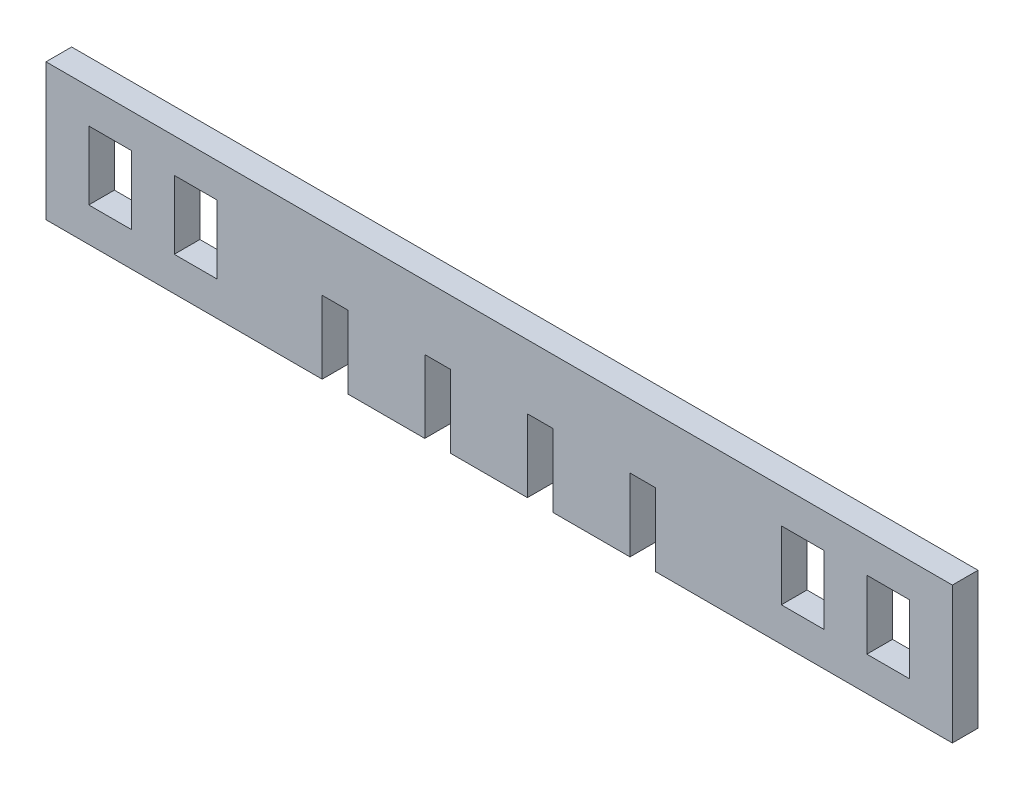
ISO-10303-21;
HEADER;
FILE_DESCRIPTION(('STEP AP214'),'2;1');
FILE_NAME('part.step','',(''),(''),'','','');
FILE_SCHEMA(('AUTOMOTIVE_DESIGN { 1 0 10303 214 1 1 1 1 }'));
ENDSEC;
DATA;
#1=APPLICATION_CONTEXT('core data for automotive mechanical design processes');
#2=APPLICATION_PROTOCOL_DEFINITION('international standard','automotive_design',2000,#1);
#3=PRODUCT_CONTEXT('',#1,'mechanical');
#4=PRODUCT('Part','Part','',(#3));
#5=PRODUCT_RELATED_PRODUCT_CATEGORY('part','',(#4));
#6=PRODUCT_DEFINITION_FORMATION('','',#4);
#7=PRODUCT_DEFINITION_CONTEXT('part definition',#1,'design');
#8=PRODUCT_DEFINITION('design','',#6,#7);
#9=PRODUCT_DEFINITION_SHAPE('','',#8);
#10=(LENGTH_UNIT() NAMED_UNIT(*) SI_UNIT(.MILLI.,.METRE.));
#11=(NAMED_UNIT(*) PLANE_ANGLE_UNIT() SI_UNIT($,.RADIAN.));
#12=(NAMED_UNIT(*) SI_UNIT($,.STERADIAN.) SOLID_ANGLE_UNIT());
#13=UNCERTAINTY_MEASURE_WITH_UNIT(LENGTH_MEASURE(1.E-05),#10,'distance_accuracy_value','');
#14=(GEOMETRIC_REPRESENTATION_CONTEXT(3) GLOBAL_UNCERTAINTY_ASSIGNED_CONTEXT((#13)) GLOBAL_UNIT_ASSIGNED_CONTEXT((#10,
#11,#12)) REPRESENTATION_CONTEXT('',''));
#15=CARTESIAN_POINT('',(0.,0.,0.));
#16=DIRECTION('',(0.,0.,1.));
#17=DIRECTION('',(1.,0.,0.));
#18=AXIS2_PLACEMENT_3D('',#15,#16,#17);
#19=CARTESIAN_POINT('',(0.,0.,3.));
#20=DIRECTION('',(0.,0.,-1.));
#21=DIRECTION('',(-1.,0.,0.));
#22=AXIS2_PLACEMENT_3D('',#19,#20,#21);
#23=PLANE('',#22);
#24=DIRECTION('',(0.,-1.,0.));
#25=VECTOR('',#24,1.);
#26=CARTESIAN_POINT('',(43.,4.,3.));
#27=LINE('',#26,#25);
#28=CARTESIAN_POINT('',(43.,4.,3.));
#29=VERTEX_POINT('',#28);
#30=CARTESIAN_POINT('',(43.,-3.99999999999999,3.));
#31=VERTEX_POINT('',#30);
#32=EDGE_CURVE('E325',#29,#31,#27,.T.);
#33=ORIENTED_EDGE('',*,*,#32,.F.);
#34=DIRECTION('',(-1.,0.,0.));
#35=VECTOR('',#34,1.);
#36=CARTESIAN_POINT('',(43.,4.,3.));
#37=LINE('',#36,#35);
#38=CARTESIAN_POINT('',(48.,4.,3.));
#39=VERTEX_POINT('',#38);
#40=EDGE_CURVE('E336',#39,#29,#37,.T.);
#41=ORIENTED_EDGE('',*,*,#40,.F.);
#42=DIRECTION('',(0.,1.,0.));
#43=VECTOR('',#42,1.);
#44=CARTESIAN_POINT('',(48.,4.,3.));
#45=LINE('',#44,#43);
#46=CARTESIAN_POINT('',(48.,-3.99999999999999,3.));
#47=VERTEX_POINT('',#46);
#48=EDGE_CURVE('E332',#47,#39,#45,.T.);
#49=ORIENTED_EDGE('',*,*,#48,.F.);
#50=DIRECTION('',(1.,0.,0.));
#51=VECTOR('',#50,1.);
#52=CARTESIAN_POINT('',(43.,-3.99999999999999,3.));
#53=LINE('',#52,#51);
#54=EDGE_CURVE('E328',#31,#47,#53,.T.);
#55=ORIENTED_EDGE('',*,*,#54,.F.);
#56=EDGE_LOOP('',(#33,#41,#49,#55));
#57=FACE_BOUND('',#56,.T.);
#58=DIRECTION('',(0.,-1.,0.));
#59=VECTOR('',#58,1.);
#60=CARTESIAN_POINT('',(-48.,4.,3.));
#61=LINE('',#60,#59);
#62=CARTESIAN_POINT('',(-48.,4.,3.));
#63=VERTEX_POINT('',#62);
#64=CARTESIAN_POINT('',(-48.,-4.,3.));
#65=VERTEX_POINT('',#64);
#66=EDGE_CURVE('E411',#63,#65,#61,.T.);
#67=ORIENTED_EDGE('',*,*,#66,.F.);
#68=DIRECTION('',(-1.,0.,0.));
#69=VECTOR('',#68,1.);
#70=CARTESIAN_POINT('',(-48.,4.,3.));
#71=LINE('',#70,#69);
#72=CARTESIAN_POINT('',(-43.,4.,3.));
#73=VERTEX_POINT('',#72);
#74=EDGE_CURVE('E422',#73,#63,#71,.T.);
#75=ORIENTED_EDGE('',*,*,#74,.F.);
#76=DIRECTION('',(0.,1.,0.));
#77=VECTOR('',#76,1.);
#78=CARTESIAN_POINT('',(-43.,4.,3.));
#79=LINE('',#78,#77);
#80=CARTESIAN_POINT('',(-43.,-4.,3.));
#81=VERTEX_POINT('',#80);
#82=EDGE_CURVE('E418',#81,#73,#79,.T.);
#83=ORIENTED_EDGE('',*,*,#82,.F.);
#84=DIRECTION('',(1.,0.,0.));
#85=VECTOR('',#84,1.);
#86=CARTESIAN_POINT('',(-48.,-4.,3.));
#87=LINE('',#86,#85);
#88=EDGE_CURVE('E414',#65,#81,#87,.T.);
#89=ORIENTED_EDGE('',*,*,#88,.F.);
#90=EDGE_LOOP('',(#67,#75,#83,#89));
#91=FACE_BOUND('',#90,.T.);
#92=DIRECTION('',(0.,1.,0.));
#93=VECTOR('',#92,1.);
#94=CARTESIAN_POINT('',(53.,-8.,3.));
#95=LINE('',#94,#93);
#96=CARTESIAN_POINT('',(53.,-8.,3.));
#97=VERTEX_POINT('',#96);
#98=CARTESIAN_POINT('',(53.,8.,3.));
#99=VERTEX_POINT('',#98);
#100=EDGE_CURVE('E454',#97,#99,#95,.T.);
#101=ORIENTED_EDGE('',*,*,#100,.T.);
#102=DIRECTION('',(-1.,0.,0.));
#103=VECTOR('',#102,1.);
#104=CARTESIAN_POINT('',(-53.,8.,3.));
#105=LINE('',#104,#103);
#106=CARTESIAN_POINT('',(-53.,8.,3.));
#107=VERTEX_POINT('',#106);
#108=EDGE_CURVE('E458',#99,#107,#105,.T.);
#109=ORIENTED_EDGE('',*,*,#108,.T.);
#110=DIRECTION('',(0.,-1.,0.));
#111=VECTOR('',#110,1.);
#112=CARTESIAN_POINT('',(-53.,-8.,3.));
#113=LINE('',#112,#111);
#114=CARTESIAN_POINT('',(-53.,-8.,3.));
#115=VERTEX_POINT('',#114);
#116=EDGE_CURVE('E462',#107,#115,#113,.T.);
#117=ORIENTED_EDGE('',*,*,#116,.T.);
#118=DIRECTION('',(1.,0.,0.));
#119=VECTOR('',#118,1.);
#120=CARTESIAN_POINT('',(-53.,-8.,3.));
#121=LINE('',#120,#119);
#122=CARTESIAN_POINT('',(-20.6999999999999,-8.,3.));
#123=VERTEX_POINT('',#122);
#124=EDGE_CURVE('E465',#115,#123,#121,.T.);
#125=ORIENTED_EDGE('',*,*,#124,.T.);
#126=DIRECTION('',(0.,1.,0.));
#127=VECTOR('',#126,1.);
#128=CARTESIAN_POINT('',(-20.6999999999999,-8.,3.));
#129=LINE('',#128,#127);
#130=CARTESIAN_POINT('',(-20.6999999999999,0.499999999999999,3.));
#131=VERTEX_POINT('',#130);
#132=EDGE_CURVE('E468',#123,#131,#129,.T.);
#133=ORIENTED_EDGE('',*,*,#132,.T.);
#134=DIRECTION('',(1.,0.,0.));
#135=VECTOR('',#134,1.);
#136=CARTESIAN_POINT('',(-17.6999999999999,0.499999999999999,3.));
#137=LINE('',#136,#135);
#138=CARTESIAN_POINT('',(-17.6999999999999,0.499999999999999,3.));
#139=VERTEX_POINT('',#138);
#140=EDGE_CURVE('E471',#131,#139,#137,.T.);
#141=ORIENTED_EDGE('',*,*,#140,.T.);
#142=DIRECTION('',(0.,-1.,0.));
#143=VECTOR('',#142,1.);
#144=CARTESIAN_POINT('',(-17.6999999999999,-8.,3.));
#145=LINE('',#144,#143);
#146=CARTESIAN_POINT('',(-17.6999999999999,-8.,3.));
#147=VERTEX_POINT('',#146);
#148=EDGE_CURVE('E474',#139,#147,#145,.T.);
#149=ORIENTED_EDGE('',*,*,#148,.T.);
#150=DIRECTION('',(1.,0.,0.));
#151=VECTOR('',#150,1.);
#152=CARTESIAN_POINT('',(-17.6999999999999,-8.,3.));
#153=LINE('',#152,#151);
#154=CARTESIAN_POINT('',(-8.69999999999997,-8.,3.));
#155=VERTEX_POINT('',#154);
#156=EDGE_CURVE('E477',#147,#155,#153,.T.);
#157=ORIENTED_EDGE('',*,*,#156,.T.);
#158=DIRECTION('',(0.,1.,0.));
#159=VECTOR('',#158,1.);
#160=CARTESIAN_POINT('',(-8.69999999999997,-8.,3.));
#161=LINE('',#160,#159);
#162=CARTESIAN_POINT('',(-8.69999999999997,0.500000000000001,3.));
#163=VERTEX_POINT('',#162);
#164=EDGE_CURVE('E480',#155,#163,#161,.T.);
#165=ORIENTED_EDGE('',*,*,#164,.T.);
#166=DIRECTION('',(1.,0.,0.));
#167=VECTOR('',#166,1.);
#168=CARTESIAN_POINT('',(-5.69999999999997,0.500000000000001,3.));
#169=LINE('',#168,#167);
#170=CARTESIAN_POINT('',(-5.69999999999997,0.500000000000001,3.));
#171=VERTEX_POINT('',#170);
#172=EDGE_CURVE('E483',#163,#171,#169,.T.);
#173=ORIENTED_EDGE('',*,*,#172,.T.);
#174=DIRECTION('',(0.,-1.,0.));
#175=VECTOR('',#174,1.);
#176=CARTESIAN_POINT('',(-5.69999999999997,-8.,3.));
#177=LINE('',#176,#175);
#178=CARTESIAN_POINT('',(-5.69999999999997,-8.,3.));
#179=VERTEX_POINT('',#178);
#180=EDGE_CURVE('E486',#171,#179,#177,.T.);
#181=ORIENTED_EDGE('',*,*,#180,.T.);
#182=DIRECTION('',(1.,0.,0.));
#183=VECTOR('',#182,1.);
#184=CARTESIAN_POINT('',(-5.69999999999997,-8.,3.));
#185=LINE('',#184,#183);
#186=CARTESIAN_POINT('',(3.30000000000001,-8.,3.));
#187=VERTEX_POINT('',#186);
#188=EDGE_CURVE('E489',#179,#187,#185,.T.);
#189=ORIENTED_EDGE('',*,*,#188,.T.);
#190=DIRECTION('',(0.,1.,0.));
#191=VECTOR('',#190,1.);
#192=CARTESIAN_POINT('',(3.30000000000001,-8.,3.));
#193=LINE('',#192,#191);
#194=CARTESIAN_POINT('',(3.30000000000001,0.5,3.));
#195=VERTEX_POINT('',#194);
#196=EDGE_CURVE('E492',#187,#195,#193,.T.);
#197=ORIENTED_EDGE('',*,*,#196,.T.);
#198=DIRECTION('',(1.,0.,0.));
#199=VECTOR('',#198,1.);
#200=CARTESIAN_POINT('',(6.30000000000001,0.500000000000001,3.));
#201=LINE('',#200,#199);
#202=CARTESIAN_POINT('',(6.30000000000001,0.500000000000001,3.));
#203=VERTEX_POINT('',#202);
#204=EDGE_CURVE('E495',#195,#203,#201,.T.);
#205=ORIENTED_EDGE('',*,*,#204,.T.);
#206=DIRECTION('',(0.,-1.,0.));
#207=VECTOR('',#206,1.);
#208=CARTESIAN_POINT('',(6.30000000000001,-8.,3.));
#209=LINE('',#208,#207);
#210=CARTESIAN_POINT('',(6.30000000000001,-8.,3.));
#211=VERTEX_POINT('',#210);
#212=EDGE_CURVE('E498',#203,#211,#209,.T.);
#213=ORIENTED_EDGE('',*,*,#212,.T.);
#214=DIRECTION('',(1.,0.,0.));
#215=VECTOR('',#214,1.);
#216=CARTESIAN_POINT('',(6.30000000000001,-8.,3.));
#217=LINE('',#216,#215);
#218=CARTESIAN_POINT('',(15.3,-8.,3.));
#219=VERTEX_POINT('',#218);
#220=EDGE_CURVE('E501',#211,#219,#217,.T.);
#221=ORIENTED_EDGE('',*,*,#220,.T.);
#222=DIRECTION('',(0.,1.,0.));
#223=VECTOR('',#222,1.);
#224=CARTESIAN_POINT('',(15.3,-8.,3.));
#225=LINE('',#224,#223);
#226=CARTESIAN_POINT('',(15.3,0.500000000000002,3.));
#227=VERTEX_POINT('',#226);
#228=EDGE_CURVE('E504',#219,#227,#225,.T.);
#229=ORIENTED_EDGE('',*,*,#228,.T.);
#230=DIRECTION('',(1.,0.,0.));
#231=VECTOR('',#230,1.);
#232=CARTESIAN_POINT('',(18.3,0.500000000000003,3.));
#233=LINE('',#232,#231);
#234=CARTESIAN_POINT('',(18.3,0.500000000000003,3.));
#235=VERTEX_POINT('',#234);
#236=EDGE_CURVE('E507',#227,#235,#233,.T.);
#237=ORIENTED_EDGE('',*,*,#236,.T.);
#238=DIRECTION('',(0.,-1.,0.));
#239=VECTOR('',#238,1.);
#240=CARTESIAN_POINT('',(18.3,-8.,3.));
#241=LINE('',#240,#239);
#242=CARTESIAN_POINT('',(18.3,-8.,3.));
#243=VERTEX_POINT('',#242);
#244=EDGE_CURVE('E510',#235,#243,#241,.T.);
#245=ORIENTED_EDGE('',*,*,#244,.T.);
#246=DIRECTION('',(1.,0.,0.));
#247=VECTOR('',#246,1.);
#248=CARTESIAN_POINT('',(18.3,-8.,3.));
#249=LINE('',#248,#247);
#250=EDGE_CURVE('E513',#243,#97,#249,.T.);
#251=ORIENTED_EDGE('',*,*,#250,.T.);
#252=EDGE_LOOP('',(#101,#109,#117,#125,#133,#141,#149,#157,#165,#173,#181,#189,#197,#205,#213,
#221,#229,#237,#245,#251));
#253=FACE_BOUND('',#252,.T.);
#254=DIRECTION('',(0.,-1.,0.));
#255=VECTOR('',#254,1.);
#256=CARTESIAN_POINT('',(-38.,4.,3.));
#257=LINE('',#256,#255);
#258=CARTESIAN_POINT('',(-38.,4.,3.));
#259=VERTEX_POINT('',#258);
#260=CARTESIAN_POINT('',(-38.,-4.,3.));
#261=VERTEX_POINT('',#260);
#262=EDGE_CURVE('E368',#259,#261,#257,.T.);
#263=ORIENTED_EDGE('',*,*,#262,.F.);
#264=DIRECTION('',(-1.,0.,0.));
#265=VECTOR('',#264,1.);
#266=CARTESIAN_POINT('',(-38.,4.,3.));
#267=LINE('',#266,#265);
#268=CARTESIAN_POINT('',(-33.,4.,3.));
#269=VERTEX_POINT('',#268);
#270=EDGE_CURVE('E379',#269,#259,#267,.T.);
#271=ORIENTED_EDGE('',*,*,#270,.F.);
#272=DIRECTION('',(0.,1.,0.));
#273=VECTOR('',#272,1.);
#274=CARTESIAN_POINT('',(-33.,4.,3.));
#275=LINE('',#274,#273);
#276=CARTESIAN_POINT('',(-33.,-4.,3.));
#277=VERTEX_POINT('',#276);
#278=EDGE_CURVE('E375',#277,#269,#275,.T.);
#279=ORIENTED_EDGE('',*,*,#278,.F.);
#280=DIRECTION('',(1.,0.,0.));
#281=VECTOR('',#280,1.);
#282=CARTESIAN_POINT('',(-38.,-4.,3.));
#283=LINE('',#282,#281);
#284=EDGE_CURVE('E371',#261,#277,#283,.T.);
#285=ORIENTED_EDGE('',*,*,#284,.F.);
#286=EDGE_LOOP('',(#263,#271,#279,#285));
#287=FACE_BOUND('',#286,.T.);
#288=DIRECTION('',(0.,-1.,0.));
#289=VECTOR('',#288,1.);
#290=CARTESIAN_POINT('',(33.,4.,3.));
#291=LINE('',#290,#289);
#292=CARTESIAN_POINT('',(33.,4.,3.));
#293=VERTEX_POINT('',#292);
#294=CARTESIAN_POINT('',(33.,-4.,3.));
#295=VERTEX_POINT('',#294);
#296=EDGE_CURVE('E277',#293,#295,#291,.T.);
#297=ORIENTED_EDGE('',*,*,#296,.F.);
#298=DIRECTION('',(-1.,0.,0.));
#299=VECTOR('',#298,1.);
#300=CARTESIAN_POINT('',(33.,4.,3.));
#301=LINE('',#300,#299);
#302=CARTESIAN_POINT('',(38.,4.,3.));
#303=VERTEX_POINT('',#302);
#304=EDGE_CURVE('E303',#303,#293,#301,.T.);
#305=ORIENTED_EDGE('',*,*,#304,.F.);
#306=DIRECTION('',(0.,1.,0.));
#307=VECTOR('',#306,1.);
#308=CARTESIAN_POINT('',(38.,4.,3.));
#309=LINE('',#308,#307);
#310=CARTESIAN_POINT('',(38.,-4.,3.));
#311=VERTEX_POINT('',#310);
#312=EDGE_CURVE('E299',#311,#303,#309,.T.);
#313=ORIENTED_EDGE('',*,*,#312,.F.);
#314=DIRECTION('',(1.,0.,0.));
#315=VECTOR('',#314,1.);
#316=CARTESIAN_POINT('',(33.,-4.,3.));
#317=LINE('',#316,#315);
#318=EDGE_CURVE('E286',#295,#311,#317,.T.);
#319=ORIENTED_EDGE('',*,*,#318,.F.);
#320=EDGE_LOOP('',(#297,#305,#313,#319));
#321=FACE_BOUND('',#320,.T.);
#322=ADVANCED_FACE('F43',(#57,#91,#253,#287,#321),#23,.F.);
#323=CARTESIAN_POINT('',(0.,0.,0.));
#324=DIRECTION('',(0.,0.,-1.));
#325=DIRECTION('',(-1.,0.,0.));
#326=AXIS2_PLACEMENT_3D('',#323,#324,#325);
#327=PLANE('',#326);
#328=DIRECTION('',(0.,1.,0.));
#329=VECTOR('',#328,1.);
#330=CARTESIAN_POINT('',(53.,-8.,0.));
#331=LINE('',#330,#329);
#332=CARTESIAN_POINT('',(53.,-8.,0.));
#333=VERTEX_POINT('',#332);
#334=CARTESIAN_POINT('',(53.,8.,0.));
#335=VERTEX_POINT('',#334);
#336=EDGE_CURVE('E453',#333,#335,#331,.T.);
#337=ORIENTED_EDGE('',*,*,#336,.F.);
#338=DIRECTION('',(1.,0.,0.));
#339=VECTOR('',#338,1.);
#340=CARTESIAN_POINT('',(18.3,-8.,0.));
#341=LINE('',#340,#339);
#342=CARTESIAN_POINT('',(18.3,-8.,0.));
#343=VERTEX_POINT('',#342);
#344=EDGE_CURVE('E459',#343,#333,#341,.T.);
#345=ORIENTED_EDGE('',*,*,#344,.F.);
#346=DIRECTION('',(0.,-1.,0.));
#347=VECTOR('',#346,1.);
#348=CARTESIAN_POINT('',(18.3,-8.,0.));
#349=LINE('',#348,#347);
#350=CARTESIAN_POINT('',(18.3,0.500000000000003,0.));
#351=VERTEX_POINT('',#350);
#352=EDGE_CURVE('E571',#351,#343,#349,.T.);
#353=ORIENTED_EDGE('',*,*,#352,.F.);
#354=DIRECTION('',(1.,0.,0.));
#355=VECTOR('',#354,1.);
#356=CARTESIAN_POINT('',(18.3,0.500000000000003,0.));
#357=LINE('',#356,#355);
#358=CARTESIAN_POINT('',(15.3,0.500000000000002,0.));
#359=VERTEX_POINT('',#358);
#360=EDGE_CURVE('E568',#359,#351,#357,.T.);
#361=ORIENTED_EDGE('',*,*,#360,.F.);
#362=DIRECTION('',(0.,1.,0.));
#363=VECTOR('',#362,1.);
#364=CARTESIAN_POINT('',(15.3,-8.,0.));
#365=LINE('',#364,#363);
#366=CARTESIAN_POINT('',(15.3,-8.,0.));
#367=VERTEX_POINT('',#366);
#368=EDGE_CURVE('E565',#367,#359,#365,.T.);
#369=ORIENTED_EDGE('',*,*,#368,.F.);
#370=DIRECTION('',(1.,0.,0.));
#371=VECTOR('',#370,1.);
#372=CARTESIAN_POINT('',(6.30000000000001,-8.,0.));
#373=LINE('',#372,#371);
#374=CARTESIAN_POINT('',(6.30000000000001,-8.,0.));
#375=VERTEX_POINT('',#374);
#376=EDGE_CURVE('E562',#375,#367,#373,.T.);
#377=ORIENTED_EDGE('',*,*,#376,.F.);
#378=DIRECTION('',(0.,-1.,0.));
#379=VECTOR('',#378,1.);
#380=CARTESIAN_POINT('',(6.30000000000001,-8.,0.));
#381=LINE('',#380,#379);
#382=CARTESIAN_POINT('',(6.30000000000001,0.500000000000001,0.));
#383=VERTEX_POINT('',#382);
#384=EDGE_CURVE('E559',#383,#375,#381,.T.);
#385=ORIENTED_EDGE('',*,*,#384,.F.);
#386=DIRECTION('',(1.,0.,0.));
#387=VECTOR('',#386,1.);
#388=CARTESIAN_POINT('',(6.30000000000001,0.500000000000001,0.));
#389=LINE('',#388,#387);
#390=CARTESIAN_POINT('',(3.30000000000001,0.5,0.));
#391=VERTEX_POINT('',#390);
#392=EDGE_CURVE('E556',#391,#383,#389,.T.);
#393=ORIENTED_EDGE('',*,*,#392,.F.);
#394=DIRECTION('',(0.,1.,0.));
#395=VECTOR('',#394,1.);
#396=CARTESIAN_POINT('',(3.30000000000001,-8.,0.));
#397=LINE('',#396,#395);
#398=CARTESIAN_POINT('',(3.30000000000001,-8.,0.));
#399=VERTEX_POINT('',#398);
#400=EDGE_CURVE('E553',#399,#391,#397,.T.);
#401=ORIENTED_EDGE('',*,*,#400,.F.);
#402=DIRECTION('',(1.,0.,0.));
#403=VECTOR('',#402,1.);
#404=CARTESIAN_POINT('',(-5.69999999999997,-8.,0.));
#405=LINE('',#404,#403);
#406=CARTESIAN_POINT('',(-5.69999999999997,-8.,0.));
#407=VERTEX_POINT('',#406);
#408=EDGE_CURVE('E550',#407,#399,#405,.T.);
#409=ORIENTED_EDGE('',*,*,#408,.F.);
#410=DIRECTION('',(0.,-1.,0.));
#411=VECTOR('',#410,1.);
#412=CARTESIAN_POINT('',(-5.69999999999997,-8.,0.));
#413=LINE('',#412,#411);
#414=CARTESIAN_POINT('',(-5.69999999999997,0.500000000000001,0.));
#415=VERTEX_POINT('',#414);
#416=EDGE_CURVE('E547',#415,#407,#413,.T.);
#417=ORIENTED_EDGE('',*,*,#416,.F.);
#418=DIRECTION('',(1.,0.,0.));
#419=VECTOR('',#418,1.);
#420=CARTESIAN_POINT('',(-5.69999999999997,0.500000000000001,0.));
#421=LINE('',#420,#419);
#422=CARTESIAN_POINT('',(-8.69999999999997,0.500000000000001,0.));
#423=VERTEX_POINT('',#422);
#424=EDGE_CURVE('E544',#423,#415,#421,.T.);
#425=ORIENTED_EDGE('',*,*,#424,.F.);
#426=DIRECTION('',(0.,1.,0.));
#427=VECTOR('',#426,1.);
#428=CARTESIAN_POINT('',(-8.69999999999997,-8.,0.));
#429=LINE('',#428,#427);
#430=CARTESIAN_POINT('',(-8.69999999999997,-8.,0.));
#431=VERTEX_POINT('',#430);
#432=EDGE_CURVE('E541',#431,#423,#429,.T.);
#433=ORIENTED_EDGE('',*,*,#432,.F.);
#434=DIRECTION('',(1.,0.,0.));
#435=VECTOR('',#434,1.);
#436=CARTESIAN_POINT('',(-17.6999999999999,-8.,0.));
#437=LINE('',#436,#435);
#438=CARTESIAN_POINT('',(-17.6999999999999,-8.,0.));
#439=VERTEX_POINT('',#438);
#440=EDGE_CURVE('E538',#439,#431,#437,.T.);
#441=ORIENTED_EDGE('',*,*,#440,.F.);
#442=DIRECTION('',(0.,-1.,0.));
#443=VECTOR('',#442,1.);
#444=CARTESIAN_POINT('',(-17.6999999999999,-8.,0.));
#445=LINE('',#444,#443);
#446=CARTESIAN_POINT('',(-17.6999999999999,0.499999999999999,0.));
#447=VERTEX_POINT('',#446);
#448=EDGE_CURVE('E535',#447,#439,#445,.T.);
#449=ORIENTED_EDGE('',*,*,#448,.F.);
#450=DIRECTION('',(1.,0.,0.));
#451=VECTOR('',#450,1.);
#452=CARTESIAN_POINT('',(-17.6999999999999,0.499999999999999,0.));
#453=LINE('',#452,#451);
#454=CARTESIAN_POINT('',(-20.6999999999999,0.499999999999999,0.));
#455=VERTEX_POINT('',#454);
#456=EDGE_CURVE('E532',#455,#447,#453,.T.);
#457=ORIENTED_EDGE('',*,*,#456,.F.);
#458=DIRECTION('',(0.,1.,0.));
#459=VECTOR('',#458,1.);
#460=CARTESIAN_POINT('',(-20.6999999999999,-8.,0.));
#461=LINE('',#460,#459);
#462=CARTESIAN_POINT('',(-20.6999999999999,-8.,0.));
#463=VERTEX_POINT('',#462);
#464=EDGE_CURVE('E529',#463,#455,#461,.T.);
#465=ORIENTED_EDGE('',*,*,#464,.F.);
#466=DIRECTION('',(1.,0.,0.));
#467=VECTOR('',#466,1.);
#468=CARTESIAN_POINT('',(-53.,-8.,0.));
#469=LINE('',#468,#467);
#470=CARTESIAN_POINT('',(-53.,-8.,0.));
#471=VERTEX_POINT('',#470);
#472=EDGE_CURVE('E526',#471,#463,#469,.T.);
#473=ORIENTED_EDGE('',*,*,#472,.F.);
#474=DIRECTION('',(0.,-1.,0.));
#475=VECTOR('',#474,1.);
#476=CARTESIAN_POINT('',(-53.,-8.,0.));
#477=LINE('',#476,#475);
#478=CARTESIAN_POINT('',(-53.,8.,0.));
#479=VERTEX_POINT('',#478);
#480=EDGE_CURVE('E523',#479,#471,#477,.T.);
#481=ORIENTED_EDGE('',*,*,#480,.F.);
#482=DIRECTION('',(-1.,0.,0.));
#483=VECTOR('',#482,1.);
#484=CARTESIAN_POINT('',(-53.,8.,0.));
#485=LINE('',#484,#483);
#486=EDGE_CURVE('E520',#335,#479,#485,.T.);
#487=ORIENTED_EDGE('',*,*,#486,.F.);
#488=EDGE_LOOP('',(#337,#345,#353,#361,#369,#377,#385,#393,#401,#409,#417,#425,#433,#441,#449,
#457,#465,#473,#481,#487));
#489=FACE_BOUND('',#488,.T.);
#490=DIRECTION('',(-1.,0.,0.));
#491=VECTOR('',#490,1.);
#492=CARTESIAN_POINT('',(-48.,4.,0.));
#493=LINE('',#492,#491);
#494=CARTESIAN_POINT('',(-43.,4.,0.));
#495=VERTEX_POINT('',#494);
#496=CARTESIAN_POINT('',(-48.,4.,0.));
#497=VERTEX_POINT('',#496);
#498=EDGE_CURVE('E415',#495,#497,#493,.T.);
#499=ORIENTED_EDGE('',*,*,#498,.T.);
#500=DIRECTION('',(0.,-1.,0.));
#501=VECTOR('',#500,1.);
#502=CARTESIAN_POINT('',(-48.,4.,0.));
#503=LINE('',#502,#501);
#504=CARTESIAN_POINT('',(-48.,-4.,0.));
#505=VERTEX_POINT('',#504);
#506=EDGE_CURVE('E410',#497,#505,#503,.T.);
#507=ORIENTED_EDGE('',*,*,#506,.T.);
#508=DIRECTION('',(1.,0.,0.));
#509=VECTOR('',#508,1.);
#510=CARTESIAN_POINT('',(-48.,-4.,0.));
#511=LINE('',#510,#509);
#512=CARTESIAN_POINT('',(-43.,-4.,0.));
#513=VERTEX_POINT('',#512);
#514=EDGE_CURVE('E429',#505,#513,#511,.T.);
#515=ORIENTED_EDGE('',*,*,#514,.T.);
#516=DIRECTION('',(0.,1.,0.));
#517=VECTOR('',#516,1.);
#518=CARTESIAN_POINT('',(-43.,4.,0.));
#519=LINE('',#518,#517);
#520=EDGE_CURVE('E433',#513,#495,#519,.T.);
#521=ORIENTED_EDGE('',*,*,#520,.T.);
#522=EDGE_LOOP('',(#499,#507,#515,#521));
#523=FACE_BOUND('',#522,.T.);
#524=DIRECTION('',(-1.,0.,0.));
#525=VECTOR('',#524,1.);
#526=CARTESIAN_POINT('',(-38.,4.,0.));
#527=LINE('',#526,#525);
#528=CARTESIAN_POINT('',(-33.,4.,0.));
#529=VERTEX_POINT('',#528);
#530=CARTESIAN_POINT('',(-38.,4.,0.));
#531=VERTEX_POINT('',#530);
#532=EDGE_CURVE('E372',#529,#531,#527,.T.);
#533=ORIENTED_EDGE('',*,*,#532,.T.);
#534=DIRECTION('',(0.,-1.,0.));
#535=VECTOR('',#534,1.);
#536=CARTESIAN_POINT('',(-38.,4.,0.));
#537=LINE('',#536,#535);
#538=CARTESIAN_POINT('',(-38.,-4.,0.));
#539=VERTEX_POINT('',#538);
#540=EDGE_CURVE('E367',#531,#539,#537,.T.);
#541=ORIENTED_EDGE('',*,*,#540,.T.);
#542=DIRECTION('',(1.,0.,0.));
#543=VECTOR('',#542,1.);
#544=CARTESIAN_POINT('',(-38.,-4.,0.));
#545=LINE('',#544,#543);
#546=CARTESIAN_POINT('',(-33.,-4.,0.));
#547=VERTEX_POINT('',#546);
#548=EDGE_CURVE('E386',#539,#547,#545,.T.);
#549=ORIENTED_EDGE('',*,*,#548,.T.);
#550=DIRECTION('',(0.,1.,0.));
#551=VECTOR('',#550,1.);
#552=CARTESIAN_POINT('',(-33.,4.,0.));
#553=LINE('',#552,#551);
#554=EDGE_CURVE('E390',#547,#529,#553,.T.);
#555=ORIENTED_EDGE('',*,*,#554,.T.);
#556=EDGE_LOOP('',(#533,#541,#549,#555));
#557=FACE_BOUND('',#556,.T.);
#558=DIRECTION('',(-1.,0.,0.));
#559=VECTOR('',#558,1.);
#560=CARTESIAN_POINT('',(43.,4.,0.));
#561=LINE('',#560,#559);
#562=CARTESIAN_POINT('',(48.,4.,0.));
#563=VERTEX_POINT('',#562);
#564=CARTESIAN_POINT('',(43.,4.,0.));
#565=VERTEX_POINT('',#564);
#566=EDGE_CURVE('E329',#563,#565,#561,.T.);
#567=ORIENTED_EDGE('',*,*,#566,.T.);
#568=DIRECTION('',(0.,-1.,0.));
#569=VECTOR('',#568,1.);
#570=CARTESIAN_POINT('',(43.,4.,0.));
#571=LINE('',#570,#569);
#572=CARTESIAN_POINT('',(43.,-3.99999999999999,0.));
#573=VERTEX_POINT('',#572);
#574=EDGE_CURVE('E295',#565,#573,#571,.T.);
#575=ORIENTED_EDGE('',*,*,#574,.T.);
#576=DIRECTION('',(1.,0.,0.));
#577=VECTOR('',#576,1.);
#578=CARTESIAN_POINT('',(43.,-3.99999999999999,0.));
#579=LINE('',#578,#577);
#580=CARTESIAN_POINT('',(48.,-3.99999999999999,0.));
#581=VERTEX_POINT('',#580);
#582=EDGE_CURVE('E343',#573,#581,#579,.T.);
#583=ORIENTED_EDGE('',*,*,#582,.T.);
#584=DIRECTION('',(0.,1.,0.));
#585=VECTOR('',#584,1.);
#586=CARTESIAN_POINT('',(48.,4.,0.));
#587=LINE('',#586,#585);
#588=EDGE_CURVE('E347',#581,#563,#587,.T.);
#589=ORIENTED_EDGE('',*,*,#588,.T.);
#590=EDGE_LOOP('',(#567,#575,#583,#589));
#591=FACE_BOUND('',#590,.T.);
#592=DIRECTION('',(-1.,0.,0.));
#593=VECTOR('',#592,1.);
#594=CARTESIAN_POINT('',(33.,4.,0.));
#595=LINE('',#594,#593);
#596=CARTESIAN_POINT('',(38.,4.,0.));
#597=VERTEX_POINT('',#596);
#598=CARTESIAN_POINT('',(33.,4.,0.));
#599=VERTEX_POINT('',#598);
#600=EDGE_CURVE('E287',#597,#599,#595,.T.);
#601=ORIENTED_EDGE('',*,*,#600,.T.);
#602=DIRECTION('',(0.,-1.,0.));
#603=VECTOR('',#602,1.);
#604=CARTESIAN_POINT('',(33.,4.,0.));
#605=LINE('',#604,#603);
#606=CARTESIAN_POINT('',(33.,-4.,0.));
#607=VERTEX_POINT('',#606);
#608=EDGE_CURVE('E67',#599,#607,#605,.T.);
#609=ORIENTED_EDGE('',*,*,#608,.T.);
#610=DIRECTION('',(1.,0.,0.));
#611=VECTOR('',#610,1.);
#612=CARTESIAN_POINT('',(33.,-4.,0.));
#613=LINE('',#612,#611);
#614=CARTESIAN_POINT('',(38.,-4.,0.));
#615=VERTEX_POINT('',#614);
#616=EDGE_CURVE('E293',#607,#615,#613,.T.);
#617=ORIENTED_EDGE('',*,*,#616,.T.);
#618=DIRECTION('',(0.,1.,0.));
#619=VECTOR('',#618,1.);
#620=CARTESIAN_POINT('',(38.,4.,0.));
#621=LINE('',#620,#619);
#622=EDGE_CURVE('E312',#615,#597,#621,.T.);
#623=ORIENTED_EDGE('',*,*,#622,.T.);
#624=EDGE_LOOP('',(#601,#609,#617,#623));
#625=FACE_BOUND('',#624,.T.);
#626=ADVANCED_FACE('F658',(#489,#523,#557,#591,#625),#327,.T.);
#627=CARTESIAN_POINT('',(53.,-8.,3.));
#628=DIRECTION('',(-1.,0.,0.));
#629=DIRECTION('',(0.,0.,1.));
#630=AXIS2_PLACEMENT_3D('',#627,#628,#629);
#631=PLANE('',#630);
#632=ORIENTED_EDGE('',*,*,#336,.T.);
#633=DIRECTION('',(0.,0.,-1.));
#634=VECTOR('',#633,1.);
#635=CARTESIAN_POINT('',(53.,8.,3.));
#636=LINE('',#635,#634);
#637=EDGE_CURVE('E11',#99,#335,#636,.T.);
#638=ORIENTED_EDGE('',*,*,#637,.F.);
#639=ORIENTED_EDGE('',*,*,#100,.F.);
#640=DIRECTION('',(0.,0.,-1.));
#641=VECTOR('',#640,1.);
#642=CARTESIAN_POINT('',(53.,-8.,3.));
#643=LINE('',#642,#641);
#644=EDGE_CURVE('E516',#97,#333,#643,.T.);
#645=ORIENTED_EDGE('',*,*,#644,.T.);
#646=EDGE_LOOP('',(#632,#638,#639,#645));
#647=FACE_BOUND('',#646,.T.);
#648=ADVANCED_FACE('F45',(#647),#631,.F.);
#649=CARTESIAN_POINT('',(-53.,8.,3.));
#650=DIRECTION('',(0.,-1.,0.));
#651=DIRECTION('',(0.,0.,-1.));
#652=AXIS2_PLACEMENT_3D('',#649,#650,#651);
#653=PLANE('',#652);
#654=ORIENTED_EDGE('',*,*,#486,.T.);
#655=DIRECTION('',(0.,0.,-1.));
#656=VECTOR('',#655,1.);
#657=CARTESIAN_POINT('',(-53.,8.,3.));
#658=LINE('',#657,#656);
#659=EDGE_CURVE('E52',#107,#479,#658,.T.);
#660=ORIENTED_EDGE('',*,*,#659,.F.);
#661=ORIENTED_EDGE('',*,*,#108,.F.);
#662=ORIENTED_EDGE('',*,*,#637,.T.);
#663=EDGE_LOOP('',(#654,#660,#661,#662));
#664=FACE_BOUND('',#663,.T.);
#665=ADVANCED_FACE('F676',(#664),#653,.F.);
#666=CARTESIAN_POINT('',(-53.,-8.,3.));
#667=DIRECTION('',(1.,0.,0.));
#668=DIRECTION('',(0.,0.,-1.));
#669=AXIS2_PLACEMENT_3D('',#666,#667,#668);
#670=PLANE('',#669);
#671=ORIENTED_EDGE('',*,*,#480,.T.);
#672=DIRECTION('',(0.,0.,-1.));
#673=VECTOR('',#672,1.);
#674=CARTESIAN_POINT('',(-53.,-8.,3.));
#675=LINE('',#674,#673);
#676=EDGE_CURVE('E643',#115,#471,#675,.T.);
#677=ORIENTED_EDGE('',*,*,#676,.F.);
#678=ORIENTED_EDGE('',*,*,#116,.F.);
#679=ORIENTED_EDGE('',*,*,#659,.T.);
#680=EDGE_LOOP('',(#671,#677,#678,#679));
#681=FACE_BOUND('',#680,.T.);
#682=ADVANCED_FACE('F652',(#681),#670,.F.);
#683=CARTESIAN_POINT('',(-53.,-8.,3.));
#684=DIRECTION('',(0.,1.,0.));
#685=DIRECTION('',(-1.,0.,0.));
#686=AXIS2_PLACEMENT_3D('',#683,#684,#685);
#687=PLANE('',#686);
#688=ORIENTED_EDGE('',*,*,#472,.T.);
#689=DIRECTION('',(0.,0.,-1.));
#690=VECTOR('',#689,1.);
#691=CARTESIAN_POINT('',(-20.6999999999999,-8.,3.));
#692=LINE('',#691,#690);
#693=EDGE_CURVE('E639',#123,#463,#692,.T.);
#694=ORIENTED_EDGE('',*,*,#693,.F.);
#695=ORIENTED_EDGE('',*,*,#124,.F.);
#696=ORIENTED_EDGE('',*,*,#676,.T.);
#697=EDGE_LOOP('',(#688,#694,#695,#696));
#698=FACE_BOUND('',#697,.T.);
#699=ADVANCED_FACE('F664',(#698),#687,.F.);
#700=CARTESIAN_POINT('',(-20.6999999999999,-8.,3.));
#701=DIRECTION('',(-1.,0.,0.));
#702=DIRECTION('',(0.,-1.,0.));
#703=AXIS2_PLACEMENT_3D('',#700,#701,#702);
#704=PLANE('',#703);
#705=ORIENTED_EDGE('',*,*,#464,.T.);
#706=DIRECTION('',(0.,0.,-1.));
#707=VECTOR('',#706,1.);
#708=CARTESIAN_POINT('',(-20.6999999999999,0.499999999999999,3.));
#709=LINE('',#708,#707);
#710=EDGE_CURVE('E635',#131,#455,#709,.T.);
#711=ORIENTED_EDGE('',*,*,#710,.F.);
#712=ORIENTED_EDGE('',*,*,#132,.F.);
#713=ORIENTED_EDGE('',*,*,#693,.T.);
#714=EDGE_LOOP('',(#705,#711,#712,#713));
#715=FACE_BOUND('',#714,.T.);
#716=ADVANCED_FACE('F668',(#715),#704,.F.);
#717=CARTESIAN_POINT('',(-17.6999999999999,0.499999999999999,3.));
#718=DIRECTION('',(0.,1.,0.));
#719=DIRECTION('',(-1.,0.,0.));
#720=AXIS2_PLACEMENT_3D('',#717,#718,#719);
#721=PLANE('',#720);
#722=ORIENTED_EDGE('',*,*,#456,.T.);
#723=DIRECTION('',(0.,0.,-1.));
#724=VECTOR('',#723,1.);
#725=CARTESIAN_POINT('',(-17.6999999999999,0.499999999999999,3.));
#726=LINE('',#725,#724);
#727=EDGE_CURVE('E631',#139,#447,#726,.T.);
#728=ORIENTED_EDGE('',*,*,#727,.F.);
#729=ORIENTED_EDGE('',*,*,#140,.F.);
#730=ORIENTED_EDGE('',*,*,#710,.T.);
#731=EDGE_LOOP('',(#722,#728,#729,#730));
#732=FACE_BOUND('',#731,.T.);
#733=ADVANCED_FACE('F749',(#732),#721,.F.);
#734=CARTESIAN_POINT('',(-17.6999999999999,-8.,3.));
#735=DIRECTION('',(1.,0.,0.));
#736=DIRECTION('',(0.,0.,-1.));
#737=AXIS2_PLACEMENT_3D('',#734,#735,#736);
#738=PLANE('',#737);
#739=ORIENTED_EDGE('',*,*,#448,.T.);
#740=DIRECTION('',(0.,0.,-1.));
#741=VECTOR('',#740,1.);
#742=CARTESIAN_POINT('',(-17.6999999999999,-8.,3.));
#743=LINE('',#742,#741);
#744=EDGE_CURVE('E627',#147,#439,#743,.T.);
#745=ORIENTED_EDGE('',*,*,#744,.F.);
#746=ORIENTED_EDGE('',*,*,#148,.F.);
#747=ORIENTED_EDGE('',*,*,#727,.T.);
#748=EDGE_LOOP('',(#739,#745,#746,#747));
#749=FACE_BOUND('',#748,.T.);
#750=ADVANCED_FACE('F747',(#749),#738,.F.);
#751=CARTESIAN_POINT('',(-17.6999999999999,-8.,3.));
#752=DIRECTION('',(0.,1.,0.));
#753=DIRECTION('',(-1.,0.,0.));
#754=AXIS2_PLACEMENT_3D('',#751,#752,#753);
#755=PLANE('',#754);
#756=ORIENTED_EDGE('',*,*,#440,.T.);
#757=DIRECTION('',(0.,0.,-1.));
#758=VECTOR('',#757,1.);
#759=CARTESIAN_POINT('',(-8.69999999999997,-8.,3.));
#760=LINE('',#759,#758);
#761=EDGE_CURVE('E623',#155,#431,#760,.T.);
#762=ORIENTED_EDGE('',*,*,#761,.F.);
#763=ORIENTED_EDGE('',*,*,#156,.F.);
#764=ORIENTED_EDGE('',*,*,#744,.T.);
#765=EDGE_LOOP('',(#756,#762,#763,#764));
#766=FACE_BOUND('',#765,.T.);
#767=ADVANCED_FACE('F742',(#766),#755,.F.);
#768=CARTESIAN_POINT('',(-8.69999999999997,-8.,3.));
#769=DIRECTION('',(-1.,0.,0.));
#770=DIRECTION('',(0.,0.,1.));
#771=AXIS2_PLACEMENT_3D('',#768,#769,#770);
#772=PLANE('',#771);
#773=ORIENTED_EDGE('',*,*,#432,.T.);
#774=DIRECTION('',(0.,0.,-1.));
#775=VECTOR('',#774,1.);
#776=CARTESIAN_POINT('',(-8.69999999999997,0.500000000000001,3.));
#777=LINE('',#776,#775);
#778=EDGE_CURVE('E619',#163,#423,#777,.T.);
#779=ORIENTED_EDGE('',*,*,#778,.F.);
#780=ORIENTED_EDGE('',*,*,#164,.F.);
#781=ORIENTED_EDGE('',*,*,#761,.T.);
#782=EDGE_LOOP('',(#773,#779,#780,#781));
#783=FACE_BOUND('',#782,.T.);
#784=ADVANCED_FACE('F737',(#783),#772,.F.);
#785=CARTESIAN_POINT('',(-5.69999999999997,0.500000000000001,3.));
#786=DIRECTION('',(0.,1.,0.));
#787=DIRECTION('',(-1.,0.,0.));
#788=AXIS2_PLACEMENT_3D('',#785,#786,#787);
#789=PLANE('',#788);
#790=ORIENTED_EDGE('',*,*,#424,.T.);
#791=DIRECTION('',(0.,0.,-1.));
#792=VECTOR('',#791,1.);
#793=CARTESIAN_POINT('',(-5.69999999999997,0.500000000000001,3.));
#794=LINE('',#793,#792);
#795=EDGE_CURVE('E615',#171,#415,#794,.T.);
#796=ORIENTED_EDGE('',*,*,#795,.F.);
#797=ORIENTED_EDGE('',*,*,#172,.F.);
#798=ORIENTED_EDGE('',*,*,#778,.T.);
#799=EDGE_LOOP('',(#790,#796,#797,#798));
#800=FACE_BOUND('',#799,.T.);
#801=ADVANCED_FACE('F733',(#800),#789,.F.);
#802=CARTESIAN_POINT('',(-5.69999999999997,-8.,3.));
#803=DIRECTION('',(1.,0.,0.));
#804=DIRECTION('',(0.,0.,-1.));
#805=AXIS2_PLACEMENT_3D('',#802,#803,#804);
#806=PLANE('',#805);
#807=ORIENTED_EDGE('',*,*,#416,.T.);
#808=DIRECTION('',(0.,0.,-1.));
#809=VECTOR('',#808,1.);
#810=CARTESIAN_POINT('',(-5.69999999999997,-8.,3.));
#811=LINE('',#810,#809);
#812=EDGE_CURVE('E611',#179,#407,#811,.T.);
#813=ORIENTED_EDGE('',*,*,#812,.F.);
#814=ORIENTED_EDGE('',*,*,#180,.F.);
#815=ORIENTED_EDGE('',*,*,#795,.T.);
#816=EDGE_LOOP('',(#807,#813,#814,#815));
#817=FACE_BOUND('',#816,.T.);
#818=ADVANCED_FACE('F728',(#817),#806,.F.);
#819=CARTESIAN_POINT('',(-5.69999999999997,-8.,3.));
#820=DIRECTION('',(0.,1.,0.));
#821=DIRECTION('',(0.,0.,1.));
#822=AXIS2_PLACEMENT_3D('',#819,#820,#821);
#823=PLANE('',#822);
#824=ORIENTED_EDGE('',*,*,#408,.T.);
#825=DIRECTION('',(0.,0.,-1.));
#826=VECTOR('',#825,1.);
#827=CARTESIAN_POINT('',(3.30000000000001,-8.,3.));
#828=LINE('',#827,#826);
#829=EDGE_CURVE('E607',#187,#399,#828,.T.);
#830=ORIENTED_EDGE('',*,*,#829,.F.);
#831=ORIENTED_EDGE('',*,*,#188,.F.);
#832=ORIENTED_EDGE('',*,*,#812,.T.);
#833=EDGE_LOOP('',(#824,#830,#831,#832));
#834=FACE_BOUND('',#833,.T.);
#835=ADVANCED_FACE('F722',(#834),#823,.F.);
#836=CARTESIAN_POINT('',(3.30000000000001,-8.,3.));
#837=DIRECTION('',(-1.,0.,0.));
#838=DIRECTION('',(0.,-1.,0.));
#839=AXIS2_PLACEMENT_3D('',#836,#837,#838);
#840=PLANE('',#839);
#841=ORIENTED_EDGE('',*,*,#400,.T.);
#842=DIRECTION('',(0.,0.,-1.));
#843=VECTOR('',#842,1.);
#844=CARTESIAN_POINT('',(3.30000000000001,0.5,3.));
#845=LINE('',#844,#843);
#846=EDGE_CURVE('E603',#195,#391,#845,.T.);
#847=ORIENTED_EDGE('',*,*,#846,.F.);
#848=ORIENTED_EDGE('',*,*,#196,.F.);
#849=ORIENTED_EDGE('',*,*,#829,.T.);
#850=EDGE_LOOP('',(#841,#847,#848,#849));
#851=FACE_BOUND('',#850,.T.);
#852=ADVANCED_FACE('F718',(#851),#840,.F.);
#853=CARTESIAN_POINT('',(6.30000000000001,0.500000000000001,3.));
#854=DIRECTION('',(0.,1.,0.));
#855=DIRECTION('',(-1.,0.,0.));
#856=AXIS2_PLACEMENT_3D('',#853,#854,#855);
#857=PLANE('',#856);
#858=ORIENTED_EDGE('',*,*,#392,.T.);
#859=DIRECTION('',(0.,0.,-1.));
#860=VECTOR('',#859,1.);
#861=CARTESIAN_POINT('',(6.30000000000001,0.500000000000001,3.));
#862=LINE('',#861,#860);
#863=EDGE_CURVE('E599',#203,#383,#862,.T.);
#864=ORIENTED_EDGE('',*,*,#863,.F.);
#865=ORIENTED_EDGE('',*,*,#204,.F.);
#866=ORIENTED_EDGE('',*,*,#846,.T.);
#867=EDGE_LOOP('',(#858,#864,#865,#866));
#868=FACE_BOUND('',#867,.T.);
#869=ADVANCED_FACE('F713',(#868),#857,.F.);
#870=CARTESIAN_POINT('',(6.30000000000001,-8.,3.));
#871=DIRECTION('',(1.,0.,0.));
#872=DIRECTION('',(0.,0.,-1.));
#873=AXIS2_PLACEMENT_3D('',#870,#871,#872);
#874=PLANE('',#873);
#875=ORIENTED_EDGE('',*,*,#384,.T.);
#876=DIRECTION('',(0.,0.,-1.));
#877=VECTOR('',#876,1.);
#878=CARTESIAN_POINT('',(6.30000000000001,-8.,3.));
#879=LINE('',#878,#877);
#880=EDGE_CURVE('E595',#211,#375,#879,.T.);
#881=ORIENTED_EDGE('',*,*,#880,.F.);
#882=ORIENTED_EDGE('',*,*,#212,.F.);
#883=ORIENTED_EDGE('',*,*,#863,.T.);
#884=EDGE_LOOP('',(#875,#881,#882,#883));
#885=FACE_BOUND('',#884,.T.);
#886=ADVANCED_FACE('F707',(#885),#874,.F.);
#887=CARTESIAN_POINT('',(6.30000000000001,-8.,3.));
#888=DIRECTION('',(0.,1.,0.));
#889=DIRECTION('',(0.,0.,1.));
#890=AXIS2_PLACEMENT_3D('',#887,#888,#889);
#891=PLANE('',#890);
#892=ORIENTED_EDGE('',*,*,#376,.T.);
#893=DIRECTION('',(0.,0.,-1.));
#894=VECTOR('',#893,1.);
#895=CARTESIAN_POINT('',(15.3,-8.,3.));
#896=LINE('',#895,#894);
#897=EDGE_CURVE('E591',#219,#367,#896,.T.);
#898=ORIENTED_EDGE('',*,*,#897,.F.);
#899=ORIENTED_EDGE('',*,*,#220,.F.);
#900=ORIENTED_EDGE('',*,*,#880,.T.);
#901=EDGE_LOOP('',(#892,#898,#899,#900));
#902=FACE_BOUND('',#901,.T.);
#903=ADVANCED_FACE('F703',(#902),#891,.F.);
#904=CARTESIAN_POINT('',(15.3,-8.,3.));
#905=DIRECTION('',(-1.,0.,0.));
#906=DIRECTION('',(0.,-1.,0.));
#907=AXIS2_PLACEMENT_3D('',#904,#905,#906);
#908=PLANE('',#907);
#909=ORIENTED_EDGE('',*,*,#368,.T.);
#910=DIRECTION('',(0.,0.,-1.));
#911=VECTOR('',#910,1.);
#912=CARTESIAN_POINT('',(15.3,0.500000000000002,3.));
#913=LINE('',#912,#911);
#914=EDGE_CURVE('E587',#227,#359,#913,.T.);
#915=ORIENTED_EDGE('',*,*,#914,.F.);
#916=ORIENTED_EDGE('',*,*,#228,.F.);
#917=ORIENTED_EDGE('',*,*,#897,.T.);
#918=EDGE_LOOP('',(#909,#915,#916,#917));
#919=FACE_BOUND('',#918,.T.);
#920=ADVANCED_FACE('F698',(#919),#908,.F.);
#921=CARTESIAN_POINT('',(18.3,0.500000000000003,3.));
#922=DIRECTION('',(0.,1.,0.));
#923=DIRECTION('',(-1.,0.,0.));
#924=AXIS2_PLACEMENT_3D('',#921,#922,#923);
#925=PLANE('',#924);
#926=ORIENTED_EDGE('',*,*,#360,.T.);
#927=DIRECTION('',(0.,0.,-1.));
#928=VECTOR('',#927,1.);
#929=CARTESIAN_POINT('',(18.3,0.500000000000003,3.));
#930=LINE('',#929,#928);
#931=EDGE_CURVE('E583',#235,#351,#930,.T.);
#932=ORIENTED_EDGE('',*,*,#931,.F.);
#933=ORIENTED_EDGE('',*,*,#236,.F.);
#934=ORIENTED_EDGE('',*,*,#914,.T.);
#935=EDGE_LOOP('',(#926,#932,#933,#934));
#936=FACE_BOUND('',#935,.T.);
#937=ADVANCED_FACE('F692',(#936),#925,.F.);
#938=CARTESIAN_POINT('',(18.3,-8.,3.));
#939=DIRECTION('',(1.,0.,0.));
#940=DIRECTION('',(0.,0.,-1.));
#941=AXIS2_PLACEMENT_3D('',#938,#939,#940);
#942=PLANE('',#941);
#943=ORIENTED_EDGE('',*,*,#352,.T.);
#944=DIRECTION('',(0.,0.,-1.));
#945=VECTOR('',#944,1.);
#946=CARTESIAN_POINT('',(18.3,-8.,3.));
#947=LINE('',#946,#945);
#948=EDGE_CURVE('E579',#243,#343,#947,.T.);
#949=ORIENTED_EDGE('',*,*,#948,.F.);
#950=ORIENTED_EDGE('',*,*,#244,.F.);
#951=ORIENTED_EDGE('',*,*,#931,.T.);
#952=EDGE_LOOP('',(#943,#949,#950,#951));
#953=FACE_BOUND('',#952,.T.);
#954=ADVANCED_FACE('F688',(#953),#942,.F.);
#955=CARTESIAN_POINT('',(18.3,-8.,3.));
#956=DIRECTION('',(0.,1.,0.));
#957=DIRECTION('',(0.,0.,1.));
#958=AXIS2_PLACEMENT_3D('',#955,#956,#957);
#959=PLANE('',#958);
#960=ORIENTED_EDGE('',*,*,#344,.T.);
#961=ORIENTED_EDGE('',*,*,#644,.F.);
#962=ORIENTED_EDGE('',*,*,#250,.F.);
#963=ORIENTED_EDGE('',*,*,#948,.T.);
#964=EDGE_LOOP('',(#960,#961,#962,#963));
#965=FACE_BOUND('',#964,.T.);
#966=ADVANCED_FACE('F683',(#965),#959,.F.);
#967=CARTESIAN_POINT('',(-48.,4.,3.));
#968=DIRECTION('',(1.,0.,0.));
#969=DIRECTION('',(0.,1.,0.));
#970=AXIS2_PLACEMENT_3D('',#967,#968,#969);
#971=PLANE('',#970);
#972=ORIENTED_EDGE('',*,*,#506,.F.);
#973=DIRECTION('',(0.,0.,-1.));
#974=VECTOR('',#973,1.);
#975=CARTESIAN_POINT('',(-48.,4.,3.));
#976=LINE('',#975,#974);
#977=EDGE_CURVE('E425',#63,#497,#976,.T.);
#978=ORIENTED_EDGE('',*,*,#977,.F.);
#979=ORIENTED_EDGE('',*,*,#66,.T.);
#980=DIRECTION('',(0.,0.,-1.));
#981=VECTOR('',#980,1.);
#982=CARTESIAN_POINT('',(-48.,-4.,3.));
#983=LINE('',#982,#981);
#984=EDGE_CURVE('E449',#65,#505,#983,.T.);
#985=ORIENTED_EDGE('',*,*,#984,.T.);
#986=EDGE_LOOP('',(#972,#978,#979,#985));
#987=FACE_BOUND('',#986,.T.);
#988=ADVANCED_FACE('F768',(#987),#971,.T.);
#989=CARTESIAN_POINT('',(-48.,-4.,3.));
#990=DIRECTION('',(0.,1.,0.));
#991=DIRECTION('',(0.,0.,1.));
#992=AXIS2_PLACEMENT_3D('',#989,#990,#991);
#993=PLANE('',#992);
#994=ORIENTED_EDGE('',*,*,#514,.F.);
#995=ORIENTED_EDGE('',*,*,#984,.F.);
#996=ORIENTED_EDGE('',*,*,#88,.T.);
#997=DIRECTION('',(0.,0.,-1.));
#998=VECTOR('',#997,1.);
#999=CARTESIAN_POINT('',(-43.,-4.,3.));
#1000=LINE('',#999,#998);
#1001=EDGE_CURVE('E446',#81,#513,#1000,.T.);
#1002=ORIENTED_EDGE('',*,*,#1001,.T.);
#1003=EDGE_LOOP('',(#994,#995,#996,#1002));
#1004=FACE_BOUND('',#1003,.T.);
#1005=ADVANCED_FACE('F854',(#1004),#993,.T.);
#1006=CARTESIAN_POINT('',(-43.,4.,3.));
#1007=DIRECTION('',(-1.,0.,0.));
#1008=DIRECTION('',(0.,0.,1.));
#1009=AXIS2_PLACEMENT_3D('',#1006,#1007,#1008);
#1010=PLANE('',#1009);
#1011=ORIENTED_EDGE('',*,*,#520,.F.);
#1012=ORIENTED_EDGE('',*,*,#1001,.F.);
#1013=ORIENTED_EDGE('',*,*,#82,.T.);
#1014=DIRECTION('',(0.,0.,-1.));
#1015=VECTOR('',#1014,1.);
#1016=CARTESIAN_POINT('',(-43.,4.,3.));
#1017=LINE('',#1016,#1015);
#1018=EDGE_CURVE('E443',#73,#495,#1017,.T.);
#1019=ORIENTED_EDGE('',*,*,#1018,.T.);
#1020=EDGE_LOOP('',(#1011,#1012,#1013,#1019));
#1021=FACE_BOUND('',#1020,.T.);
#1022=ADVANCED_FACE('F861',(#1021),#1010,.T.);
#1023=CARTESIAN_POINT('',(-48.,4.,3.));
#1024=DIRECTION('',(0.,-1.,0.));
#1025=DIRECTION('',(0.,0.,-1.));
#1026=AXIS2_PLACEMENT_3D('',#1023,#1024,#1025);
#1027=PLANE('',#1026);
#1028=ORIENTED_EDGE('',*,*,#498,.F.);
#1029=ORIENTED_EDGE('',*,*,#1018,.F.);
#1030=ORIENTED_EDGE('',*,*,#74,.T.);
#1031=ORIENTED_EDGE('',*,*,#977,.T.);
#1032=EDGE_LOOP('',(#1028,#1029,#1030,#1031));
#1033=FACE_BOUND('',#1032,.T.);
#1034=ADVANCED_FACE('F868',(#1033),#1027,.T.);
#1035=CARTESIAN_POINT('',(-38.,4.,3.));
#1036=DIRECTION('',(1.,0.,0.));
#1037=DIRECTION('',(0.,0.,-1.));
#1038=AXIS2_PLACEMENT_3D('',#1035,#1036,#1037);
#1039=PLANE('',#1038);
#1040=ORIENTED_EDGE('',*,*,#540,.F.);
#1041=DIRECTION('',(0.,0.,-1.));
#1042=VECTOR('',#1041,1.);
#1043=CARTESIAN_POINT('',(-38.,4.,3.));
#1044=LINE('',#1043,#1042);
#1045=EDGE_CURVE('E382',#259,#531,#1044,.T.);
#1046=ORIENTED_EDGE('',*,*,#1045,.F.);
#1047=ORIENTED_EDGE('',*,*,#262,.T.);
#1048=DIRECTION('',(0.,0.,-1.));
#1049=VECTOR('',#1048,1.);
#1050=CARTESIAN_POINT('',(-38.,-4.,3.));
#1051=LINE('',#1050,#1049);
#1052=EDGE_CURVE('E406',#261,#539,#1051,.T.);
#1053=ORIENTED_EDGE('',*,*,#1052,.T.);
#1054=EDGE_LOOP('',(#1040,#1046,#1047,#1053));
#1055=FACE_BOUND('',#1054,.T.);
#1056=ADVANCED_FACE('F876',(#1055),#1039,.T.);
#1057=CARTESIAN_POINT('',(-38.,-4.,3.));
#1058=DIRECTION('',(0.,1.,0.));
#1059=DIRECTION('',(0.,0.,1.));
#1060=AXIS2_PLACEMENT_3D('',#1057,#1058,#1059);
#1061=PLANE('',#1060);
#1062=ORIENTED_EDGE('',*,*,#548,.F.);
#1063=ORIENTED_EDGE('',*,*,#1052,.F.);
#1064=ORIENTED_EDGE('',*,*,#284,.T.);
#1065=DIRECTION('',(0.,0.,-1.));
#1066=VECTOR('',#1065,1.);
#1067=CARTESIAN_POINT('',(-33.,-4.,3.));
#1068=LINE('',#1067,#1066);
#1069=EDGE_CURVE('E403',#277,#547,#1068,.T.);
#1070=ORIENTED_EDGE('',*,*,#1069,.T.);
#1071=EDGE_LOOP('',(#1062,#1063,#1064,#1070));
#1072=FACE_BOUND('',#1071,.T.);
#1073=ADVANCED_FACE('F884',(#1072),#1061,.T.);
#1074=CARTESIAN_POINT('',(-33.,4.,3.));
#1075=DIRECTION('',(-1.,0.,0.));
#1076=DIRECTION('',(0.,-1.,0.));
#1077=AXIS2_PLACEMENT_3D('',#1074,#1075,#1076);
#1078=PLANE('',#1077);
#1079=ORIENTED_EDGE('',*,*,#554,.F.);
#1080=ORIENTED_EDGE('',*,*,#1069,.F.);
#1081=ORIENTED_EDGE('',*,*,#278,.T.);
#1082=DIRECTION('',(0.,0.,-1.));
#1083=VECTOR('',#1082,1.);
#1084=CARTESIAN_POINT('',(-33.,4.,3.));
#1085=LINE('',#1084,#1083);
#1086=EDGE_CURVE('E400',#269,#529,#1085,.T.);
#1087=ORIENTED_EDGE('',*,*,#1086,.T.);
#1088=EDGE_LOOP('',(#1079,#1080,#1081,#1087));
#1089=FACE_BOUND('',#1088,.T.);
#1090=ADVANCED_FACE('F892',(#1089),#1078,.T.);
#1091=CARTESIAN_POINT('',(-38.,4.,3.));
#1092=DIRECTION('',(0.,-1.,0.));
#1093=DIRECTION('',(1.,0.,0.));
#1094=AXIS2_PLACEMENT_3D('',#1091,#1092,#1093);
#1095=PLANE('',#1094);
#1096=ORIENTED_EDGE('',*,*,#532,.F.);
#1097=ORIENTED_EDGE('',*,*,#1086,.F.);
#1098=ORIENTED_EDGE('',*,*,#270,.T.);
#1099=ORIENTED_EDGE('',*,*,#1045,.T.);
#1100=EDGE_LOOP('',(#1096,#1097,#1098,#1099));
#1101=FACE_BOUND('',#1100,.T.);
#1102=ADVANCED_FACE('F900',(#1101),#1095,.T.);
#1103=CARTESIAN_POINT('',(43.,4.,3.));
#1104=DIRECTION('',(1.,0.,0.));
#1105=DIRECTION('',(0.,0.,-1.));
#1106=AXIS2_PLACEMENT_3D('',#1103,#1104,#1105);
#1107=PLANE('',#1106);
#1108=ORIENTED_EDGE('',*,*,#574,.F.);
#1109=DIRECTION('',(0.,0.,-1.));
#1110=VECTOR('',#1109,1.);
#1111=CARTESIAN_POINT('',(43.,4.,3.));
#1112=LINE('',#1111,#1110);
#1113=EDGE_CURVE('E339',#29,#565,#1112,.T.);
#1114=ORIENTED_EDGE('',*,*,#1113,.F.);
#1115=ORIENTED_EDGE('',*,*,#32,.T.);
#1116=DIRECTION('',(0.,0.,-1.));
#1117=VECTOR('',#1116,1.);
#1118=CARTESIAN_POINT('',(43.,-3.99999999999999,3.));
#1119=LINE('',#1118,#1117);
#1120=EDGE_CURVE('E363',#31,#573,#1119,.T.);
#1121=ORIENTED_EDGE('',*,*,#1120,.T.);
#1122=EDGE_LOOP('',(#1108,#1114,#1115,#1121));
#1123=FACE_BOUND('',#1122,.T.);
#1124=ADVANCED_FACE('F908',(#1123),#1107,.T.);
#1125=CARTESIAN_POINT('',(43.,-3.99999999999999,3.));
#1126=DIRECTION('',(0.,1.,0.));
#1127=DIRECTION('',(0.,0.,1.));
#1128=AXIS2_PLACEMENT_3D('',#1125,#1126,#1127);
#1129=PLANE('',#1128);
#1130=ORIENTED_EDGE('',*,*,#582,.F.);
#1131=ORIENTED_EDGE('',*,*,#1120,.F.);
#1132=ORIENTED_EDGE('',*,*,#54,.T.);
#1133=DIRECTION('',(0.,0.,-1.));
#1134=VECTOR('',#1133,1.);
#1135=CARTESIAN_POINT('',(48.,-3.99999999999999,3.));
#1136=LINE('',#1135,#1134);
#1137=EDGE_CURVE('E360',#47,#581,#1136,.T.);
#1138=ORIENTED_EDGE('',*,*,#1137,.T.);
#1139=EDGE_LOOP('',(#1130,#1131,#1132,#1138));
#1140=FACE_BOUND('',#1139,.T.);
#1141=ADVANCED_FACE('F916',(#1140),#1129,.T.);
#1142=CARTESIAN_POINT('',(48.,4.,3.));
#1143=DIRECTION('',(-1.,0.,0.));
#1144=DIRECTION('',(0.,0.,1.));
#1145=AXIS2_PLACEMENT_3D('',#1142,#1143,#1144);
#1146=PLANE('',#1145);
#1147=ORIENTED_EDGE('',*,*,#588,.F.);
#1148=ORIENTED_EDGE('',*,*,#1137,.F.);
#1149=ORIENTED_EDGE('',*,*,#48,.T.);
#1150=DIRECTION('',(0.,0.,-1.));
#1151=VECTOR('',#1150,1.);
#1152=CARTESIAN_POINT('',(48.,4.,3.));
#1153=LINE('',#1152,#1151);
#1154=EDGE_CURVE('E357',#39,#563,#1153,.T.);
#1155=ORIENTED_EDGE('',*,*,#1154,.T.);
#1156=EDGE_LOOP('',(#1147,#1148,#1149,#1155));
#1157=FACE_BOUND('',#1156,.T.);
#1158=ADVANCED_FACE('F924',(#1157),#1146,.T.);
#1159=CARTESIAN_POINT('',(43.,4.,3.));
#1160=DIRECTION('',(0.,-1.,0.));
#1161=DIRECTION('',(0.,0.,-1.));
#1162=AXIS2_PLACEMENT_3D('',#1159,#1160,#1161);
#1163=PLANE('',#1162);
#1164=ORIENTED_EDGE('',*,*,#566,.F.);
#1165=ORIENTED_EDGE('',*,*,#1154,.F.);
#1166=ORIENTED_EDGE('',*,*,#40,.T.);
#1167=ORIENTED_EDGE('',*,*,#1113,.T.);
#1168=EDGE_LOOP('',(#1164,#1165,#1166,#1167));
#1169=FACE_BOUND('',#1168,.T.);
#1170=ADVANCED_FACE('F932',(#1169),#1163,.T.);
#1171=CARTESIAN_POINT('',(33.,4.,3.));
#1172=DIRECTION('',(1.,0.,0.));
#1173=DIRECTION('',(0.,0.,-1.));
#1174=AXIS2_PLACEMENT_3D('',#1171,#1172,#1173);
#1175=PLANE('',#1174);
#1176=ORIENTED_EDGE('',*,*,#608,.F.);
#1177=DIRECTION('',(0.,0.,-1.));
#1178=VECTOR('',#1177,1.);
#1179=CARTESIAN_POINT('',(33.,4.,3.));
#1180=LINE('',#1179,#1178);
#1181=EDGE_CURVE('E281',#293,#599,#1180,.T.);
#1182=ORIENTED_EDGE('',*,*,#1181,.F.);
#1183=ORIENTED_EDGE('',*,*,#296,.T.);
#1184=DIRECTION('',(0.,0.,-1.));
#1185=VECTOR('',#1184,1.);
#1186=CARTESIAN_POINT('',(33.,-4.,3.));
#1187=LINE('',#1186,#1185);
#1188=EDGE_CURVE('E280',#295,#607,#1187,.T.);
#1189=ORIENTED_EDGE('',*,*,#1188,.T.);
#1190=EDGE_LOOP('',(#1176,#1182,#1183,#1189));
#1191=FACE_BOUND('',#1190,.T.);
#1192=ADVANCED_FACE('F279',(#1191),#1175,.T.);
#1193=CARTESIAN_POINT('',(33.,-4.,3.));
#1194=DIRECTION('',(0.,1.,0.));
#1195=DIRECTION('',(0.,0.,1.));
#1196=AXIS2_PLACEMENT_3D('',#1193,#1194,#1195);
#1197=PLANE('',#1196);
#1198=ORIENTED_EDGE('',*,*,#616,.F.);
#1199=ORIENTED_EDGE('',*,*,#1188,.F.);
#1200=ORIENTED_EDGE('',*,*,#318,.T.);
#1201=DIRECTION('',(0.,0.,-1.));
#1202=VECTOR('',#1201,1.);
#1203=CARTESIAN_POINT('',(38.,-4.,3.));
#1204=LINE('',#1203,#1202);
#1205=EDGE_CURVE('E296',#311,#615,#1204,.T.);
#1206=ORIENTED_EDGE('',*,*,#1205,.T.);
#1207=EDGE_LOOP('',(#1198,#1199,#1200,#1206));
#1208=FACE_BOUND('',#1207,.T.);
#1209=ADVANCED_FACE('F290',(#1208),#1197,.T.);
#1210=CARTESIAN_POINT('',(38.,4.,3.));
#1211=DIRECTION('',(-1.,0.,0.));
#1212=DIRECTION('',(0.,0.,1.));
#1213=AXIS2_PLACEMENT_3D('',#1210,#1211,#1212);
#1214=PLANE('',#1213);
#1215=ORIENTED_EDGE('',*,*,#622,.F.);
#1216=ORIENTED_EDGE('',*,*,#1205,.F.);
#1217=ORIENTED_EDGE('',*,*,#312,.T.);
#1218=DIRECTION('',(0.,0.,-1.));
#1219=VECTOR('',#1218,1.);
#1220=CARTESIAN_POINT('',(38.,4.,3.));
#1221=LINE('',#1220,#1219);
#1222=EDGE_CURVE('E59',#303,#597,#1221,.T.);
#1223=ORIENTED_EDGE('',*,*,#1222,.T.);
#1224=EDGE_LOOP('',(#1215,#1216,#1217,#1223));
#1225=FACE_BOUND('',#1224,.T.);
#1226=ADVANCED_FACE('F953',(#1225),#1214,.T.);
#1227=CARTESIAN_POINT('',(33.,4.,3.));
#1228=DIRECTION('',(0.,-1.,0.));
#1229=DIRECTION('',(0.,0.,-1.));
#1230=AXIS2_PLACEMENT_3D('',#1227,#1228,#1229);
#1231=PLANE('',#1230);
#1232=ORIENTED_EDGE('',*,*,#600,.F.);
#1233=ORIENTED_EDGE('',*,*,#1222,.F.);
#1234=ORIENTED_EDGE('',*,*,#304,.T.);
#1235=ORIENTED_EDGE('',*,*,#1181,.T.);
#1236=EDGE_LOOP('',(#1232,#1233,#1234,#1235));
#1237=FACE_BOUND('',#1236,.T.);
#1238=ADVANCED_FACE('F960',(#1237),#1231,.T.);
#1239=CLOSED_SHELL('',(#322,#626,#648,#665,#682,#699,#716,#733,#750,#767,#784,#801,#818,#835,
#852,#869,#886,#903,#920,#937,#954,#966,#988,#1005,#1022,#1034,#1056,#1073,#1090,#1102,#1124,
#1141,#1158,#1170,#1192,#1209,#1226,#1238));
#1240=MANIFOLD_SOLID_BREP('B2',#1239);
#1241=ADVANCED_BREP_SHAPE_REPRESENTATION('',(#18,#1240),#14);
#1242=SHAPE_DEFINITION_REPRESENTATION(#9,#1241);
ENDSEC;
END-ISO-10303-21;
